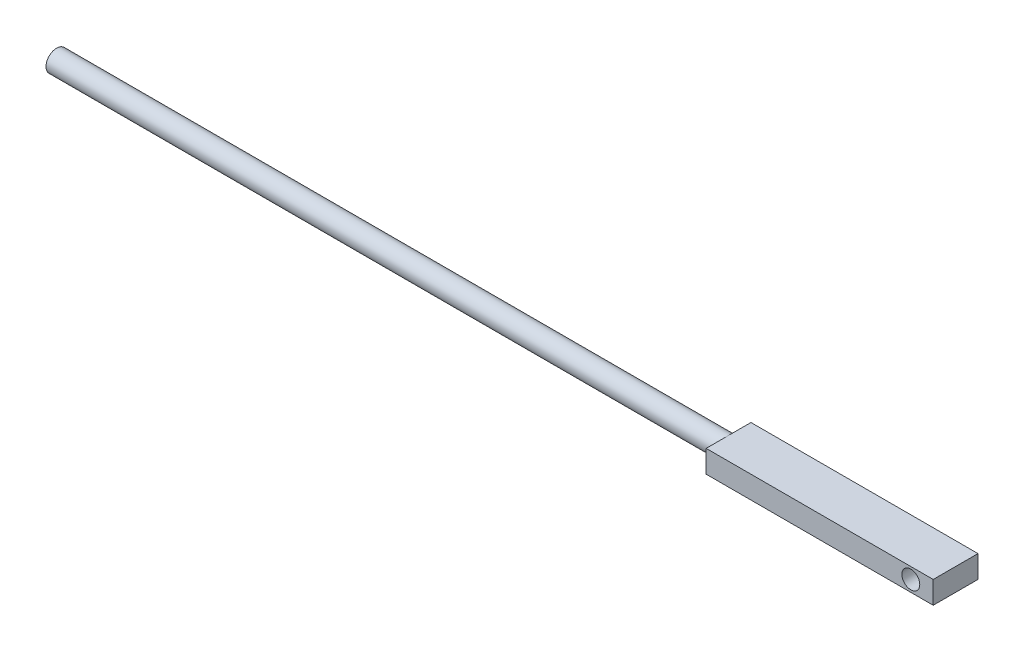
from build123d import *

# Parameters (mm, degrees)
SKIZZE1_W                       = 401.37
SKIZZE1_H                       = 10
AUFSATZ_LINEAR_AUSTRAGEN1_DEPTH = 20
SKIZZE2_R                       = 4
SCHNITT_LINEAR_AUSTRAGEN1_DEPTH = 402.992384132
SKIZZE3_OUTSIDE_W               = 102.398
SKIZZE3_OUTSIDE_H               = 92.398
SKIZZE3_OUTSIDE_R               = 4.75
SCHNITT_LINEAR_AUSTRAGEN3_DEPTH = 300


with BuildPart() as part:
    # Skizze1 → Aufsatz-Linear austragen1 (new body)
    with BuildSketch(Plane.XY):
        with Locations((200.685, 5)):
            Rectangle(SKIZZE1_W, SKIZZE1_H)
    extrude(amount=AUFSATZ_LINEAR_AUSTRAGEN1_DEPTH)

    # Skizze2 → Schnitt-Linear austragen1 (cut, through all)
    with BuildSketch(Plane.XY.offset(20)):
        with Locations((391.37, 5)):
            Circle(SKIZZE2_R)
    extrude(amount=-SCHNITT_LINEAR_AUSTRAGEN1_DEPTH, mode=Mode.SUBTRACT)

    # Skizze3 outside → Schnitt-Linear austragen3 (cut)
    with BuildSketch(Plane.ZY):
        with Locations((10, 5)):
            Rectangle(SKIZZE3_OUTSIDE_W, SKIZZE3_OUTSIDE_H)
        with Locations((10, 5)):
            Circle(SKIZZE3_OUTSIDE_R, mode=Mode.SUBTRACT)
    extrude(amount=-SCHNITT_LINEAR_AUSTRAGEN3_DEPTH, mode=Mode.SUBTRACT)


solid = part.part
